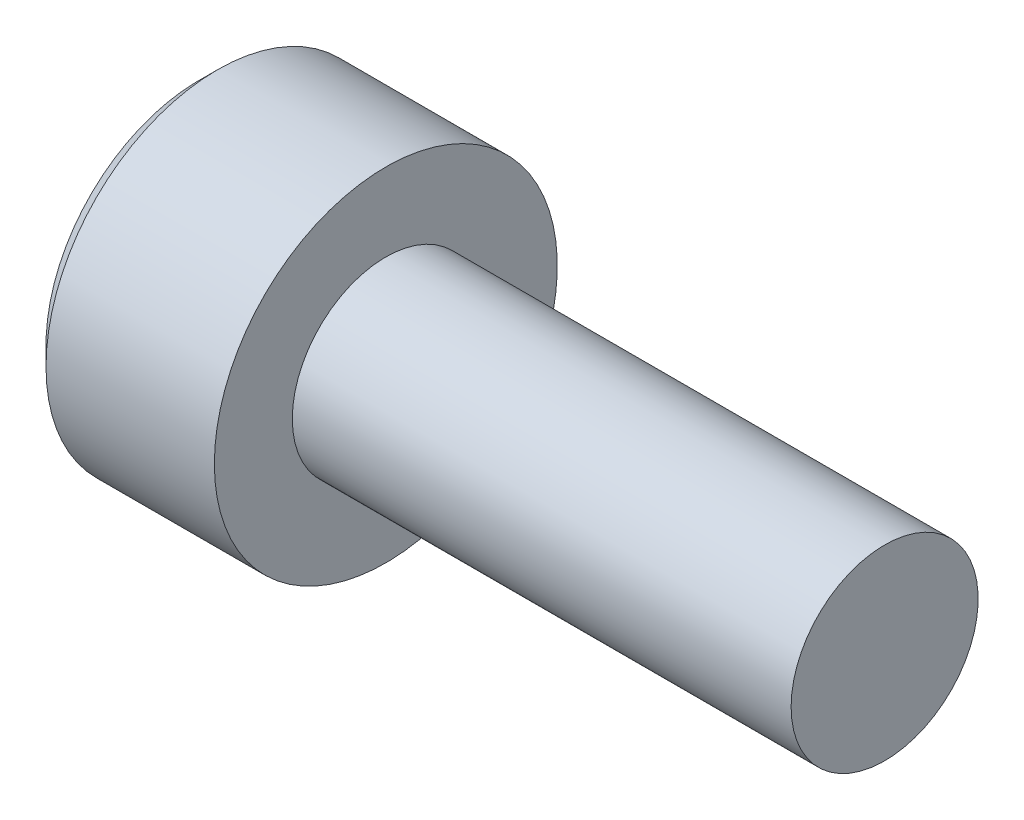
from build123d import *

# Parameters (mm, degrees)
CHAMFER1_SIZE      = 0.3
CUT_EXTRUDE1_DEPTH = 1.3


with BuildPart() as part:
    # Sketch1 → Revolve1 (revolve)
    with BuildSketch(Plane.XY, mode=Mode.PRIVATE) as revolve1_sk:
        Polygon((-3, 0), (8, 0), (8, 1.5), (0, 1.5), (0, 2.75), (-3, 2.75), align=None)
    revolve(revolve1_sk.sketch.rotate(Axis((-3, 0, 0), (1, 0, 0)), 90), axis=Axis((-3, 0, 0), (1, 0, 0)))

    # Chamfer1
    chamfer1_edges = [part.edges().sort_by_distance(p)[0] for p in [
        (-3, 0, -2.75),
    ]]
    chamfer(chamfer1_edges, length=CHAMFER1_SIZE)

    # Sketch2 → Cut-Revolve1 (revolve, cut)
    with BuildSketch(Plane.XY, mode=Mode.PRIVATE) as cut_revolve1_sk:
        Polygon((-0.948924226, 0), (-1.7, 1.25), (-3, 1.25), (-3, 0), align=None)
    revolve(cut_revolve1_sk.sketch.rotate(Axis((-3, 0, 0), (1, 0, 0)), 180), axis=Axis((-3, 0, 0), (1, 0, 0)), mode=Mode.SUBTRACT)

    # Sketch3 → Cut-Extrude1 (cut)
    with BuildSketch(Plane.ZY.offset(3)):
        Polygon((0, -1.443375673), (1.25, -0.721687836), (1.25, 0.721687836), (0, 1.443375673), (-1.25, 0.721687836), (-1.25, -0.721687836), align=None)
    extrude(amount=-CUT_EXTRUDE1_DEPTH, mode=Mode.SUBTRACT)


solid = part.part
